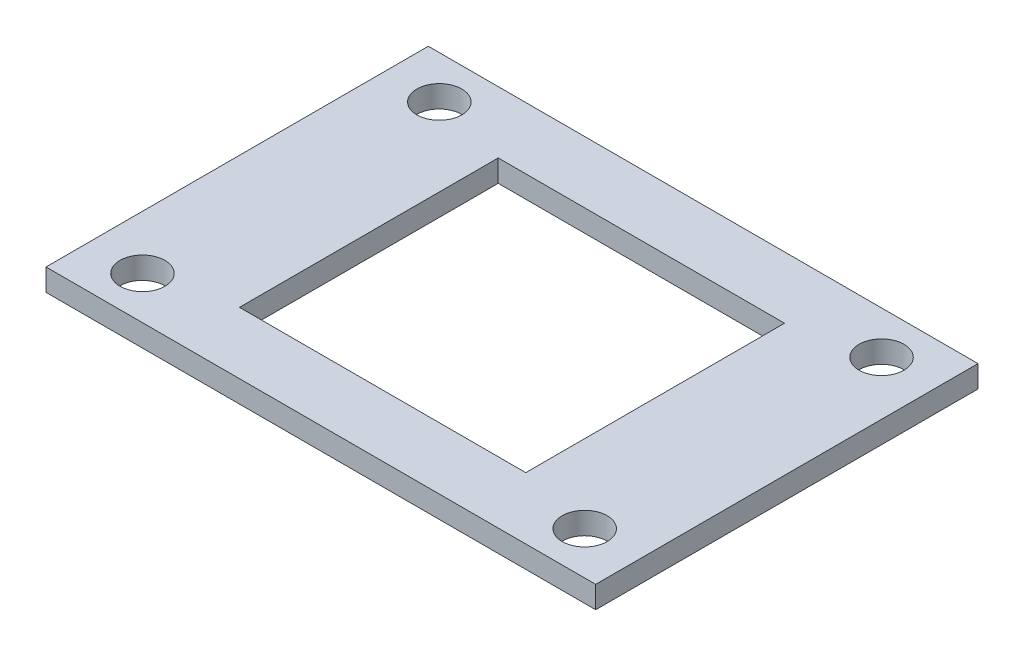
ISO-10303-21;
HEADER;
FILE_DESCRIPTION(('STEP AP214'),'2;1');
FILE_NAME('part.step','',(''),(''),'','','');
FILE_SCHEMA(('AUTOMOTIVE_DESIGN { 1 0 10303 214 1 1 1 1 }'));
ENDSEC;
DATA;
#1=APPLICATION_CONTEXT('core data for automotive mechanical design processes');
#2=APPLICATION_PROTOCOL_DEFINITION('international standard','automotive_design',2000,#1);
#3=PRODUCT_CONTEXT('',#1,'mechanical');
#4=PRODUCT('Part','Part','',(#3));
#5=PRODUCT_RELATED_PRODUCT_CATEGORY('part','',(#4));
#6=PRODUCT_DEFINITION_FORMATION('','',#4);
#7=PRODUCT_DEFINITION_CONTEXT('part definition',#1,'design');
#8=PRODUCT_DEFINITION('design','',#6,#7);
#9=PRODUCT_DEFINITION_SHAPE('','',#8);
#10=(LENGTH_UNIT() NAMED_UNIT(*) SI_UNIT(.MILLI.,.METRE.));
#11=(NAMED_UNIT(*) PLANE_ANGLE_UNIT() SI_UNIT($,.RADIAN.));
#12=(NAMED_UNIT(*) SI_UNIT($,.STERADIAN.) SOLID_ANGLE_UNIT());
#13=UNCERTAINTY_MEASURE_WITH_UNIT(LENGTH_MEASURE(1.E-05),#10,'distance_accuracy_value','');
#14=(GEOMETRIC_REPRESENTATION_CONTEXT(3) GLOBAL_UNCERTAINTY_ASSIGNED_CONTEXT((#13)) GLOBAL_UNIT_ASSIGNED_CONTEXT((#10,
#11,#12)) REPRESENTATION_CONTEXT('',''));
#15=CARTESIAN_POINT('',(0.,0.,0.));
#16=DIRECTION('',(0.,0.,1.));
#17=DIRECTION('',(1.,0.,0.));
#18=AXIS2_PLACEMENT_3D('',#15,#16,#17);
#19=CARTESIAN_POINT('',(0.,-1.,0.));
#20=DIRECTION('',(-1.,0.,0.));
#21=DIRECTION('',(0.,0.,1.));
#22=AXIS2_PLACEMENT_3D('',#19,#20,#21);
#23=PLANE('',#22);
#24=DIRECTION('',(0.,0.,1.));
#25=VECTOR('',#24,1.);
#26=CARTESIAN_POINT('',(0.,0.,0.));
#27=LINE('',#26,#25);
#28=CARTESIAN_POINT('',(0.,0.,0.));
#29=VERTEX_POINT('',#28);
#30=CARTESIAN_POINT('',(0.,0.,17.36));
#31=VERTEX_POINT('',#30);
#32=EDGE_CURVE('E134',#29,#31,#27,.T.);
#33=ORIENTED_EDGE('',*,*,#32,.F.);
#34=DIRECTION('',(0.,1.,0.));
#35=VECTOR('',#34,1.);
#36=CARTESIAN_POINT('',(0.,-1.,0.));
#37=LINE('',#36,#35);
#38=CARTESIAN_POINT('',(0.,-1.,0.));
#39=VERTEX_POINT('',#38);
#40=EDGE_CURVE('E11',#39,#29,#37,.T.);
#41=ORIENTED_EDGE('',*,*,#40,.F.);
#42=DIRECTION('',(0.,0.,1.));
#43=VECTOR('',#42,1.);
#44=CARTESIAN_POINT('',(0.,-1.,0.));
#45=LINE('',#44,#43);
#46=CARTESIAN_POINT('',(0.,-1.,17.36));
#47=VERTEX_POINT('',#46);
#48=EDGE_CURVE('E138',#39,#47,#45,.T.);
#49=ORIENTED_EDGE('',*,*,#48,.T.);
#50=DIRECTION('',(0.,1.,0.));
#51=VECTOR('',#50,1.);
#52=CARTESIAN_POINT('',(0.,-1.,17.36));
#53=LINE('',#52,#51);
#54=EDGE_CURVE('E35',#47,#31,#53,.T.);
#55=ORIENTED_EDGE('',*,*,#54,.T.);
#56=EDGE_LOOP('',(#33,#41,#49,#55));
#57=FACE_BOUND('',#56,.T.);
#58=ADVANCED_FACE('F32',(#57),#23,.T.);
#59=CARTESIAN_POINT('',(0.,-1.,0.));
#60=DIRECTION('',(0.,0.,-1.));
#61=DIRECTION('',(-1.,0.,0.));
#62=AXIS2_PLACEMENT_3D('',#59,#60,#61);
#63=PLANE('',#62);
#64=DIRECTION('',(-1.,0.,0.));
#65=VECTOR('',#64,1.);
#66=CARTESIAN_POINT('',(0.,0.,0.));
#67=LINE('',#66,#65);
#68=CARTESIAN_POINT('',(24.96,0.,0.));
#69=VERTEX_POINT('',#68);
#70=EDGE_CURVE('E142',#69,#29,#67,.T.);
#71=ORIENTED_EDGE('',*,*,#70,.F.);
#72=DIRECTION('',(0.,1.,0.));
#73=VECTOR('',#72,1.);
#74=CARTESIAN_POINT('',(24.96,-1.,0.));
#75=LINE('',#74,#73);
#76=CARTESIAN_POINT('',(24.96,-1.,0.));
#77=VERTEX_POINT('',#76);
#78=EDGE_CURVE('E40',#77,#69,#75,.T.);
#79=ORIENTED_EDGE('',*,*,#78,.F.);
#80=DIRECTION('',(-1.,0.,0.));
#81=VECTOR('',#80,1.);
#82=CARTESIAN_POINT('',(0.,-1.,0.));
#83=LINE('',#82,#81);
#84=EDGE_CURVE('E148',#77,#39,#83,.T.);
#85=ORIENTED_EDGE('',*,*,#84,.T.);
#86=ORIENTED_EDGE('',*,*,#40,.T.);
#87=EDGE_LOOP('',(#71,#79,#85,#86));
#88=FACE_BOUND('',#87,.T.);
#89=ADVANCED_FACE('F174',(#88),#63,.T.);
#90=CARTESIAN_POINT('',(24.96,-1.,0.));
#91=DIRECTION('',(1.,0.,0.));
#92=DIRECTION('',(0.,0.,-1.));
#93=AXIS2_PLACEMENT_3D('',#90,#91,#92);
#94=PLANE('',#93);
#95=DIRECTION('',(0.,0.,-1.));
#96=VECTOR('',#95,1.);
#97=CARTESIAN_POINT('',(24.96,0.,0.));
#98=LINE('',#97,#96);
#99=CARTESIAN_POINT('',(24.96,0.,17.36));
#100=VERTEX_POINT('',#99);
#101=EDGE_CURVE('E156',#100,#69,#98,.T.);
#102=ORIENTED_EDGE('',*,*,#101,.F.);
#103=DIRECTION('',(0.,1.,0.));
#104=VECTOR('',#103,1.);
#105=CARTESIAN_POINT('',(24.96,-1.,17.36));
#106=LINE('',#105,#104);
#107=CARTESIAN_POINT('',(24.96,-1.,17.36));
#108=VERTEX_POINT('',#107);
#109=EDGE_CURVE('E161',#108,#100,#106,.T.);
#110=ORIENTED_EDGE('',*,*,#109,.F.);
#111=DIRECTION('',(0.,0.,-1.));
#112=VECTOR('',#111,1.);
#113=CARTESIAN_POINT('',(24.96,-1.,0.));
#114=LINE('',#113,#112);
#115=EDGE_CURVE('E145',#108,#77,#114,.T.);
#116=ORIENTED_EDGE('',*,*,#115,.T.);
#117=ORIENTED_EDGE('',*,*,#78,.T.);
#118=EDGE_LOOP('',(#102,#110,#116,#117));
#119=FACE_BOUND('',#118,.T.);
#120=ADVANCED_FACE('F178',(#119),#94,.T.);
#121=CARTESIAN_POINT('',(0.,-1.,17.36));
#122=DIRECTION('',(0.,0.,1.));
#123=DIRECTION('',(1.,0.,0.));
#124=AXIS2_PLACEMENT_3D('',#121,#122,#123);
#125=PLANE('',#124);
#126=DIRECTION('',(1.,0.,0.));
#127=VECTOR('',#126,1.);
#128=CARTESIAN_POINT('',(0.,0.,17.36));
#129=LINE('',#128,#127);
#130=EDGE_CURVE('E153',#31,#100,#129,.T.);
#131=ORIENTED_EDGE('',*,*,#130,.F.);
#132=ORIENTED_EDGE('',*,*,#54,.F.);
#133=DIRECTION('',(1.,0.,0.));
#134=VECTOR('',#133,1.);
#135=CARTESIAN_POINT('',(0.,-1.,17.36));
#136=LINE('',#135,#134);
#137=EDGE_CURVE('E141',#47,#108,#136,.T.);
#138=ORIENTED_EDGE('',*,*,#137,.T.);
#139=ORIENTED_EDGE('',*,*,#109,.T.);
#140=EDGE_LOOP('',(#131,#132,#138,#139));
#141=FACE_BOUND('',#140,.T.);
#142=ADVANCED_FACE('F169',(#141),#125,.T.);
#143=CARTESIAN_POINT('',(0.,-1.,0.));
#144=DIRECTION('',(0.,1.,0.));
#145=DIRECTION('',(0.,0.,1.));
#146=AXIS2_PLACEMENT_3D('',#143,#144,#145);
#147=PLANE('',#146);
#148=CARTESIAN_POINT('',(2.44,-1.,15.42));
#149=DIRECTION('',(0.,1.,0.));
#150=DIRECTION('',(0.,0.,1.));
#151=AXIS2_PLACEMENT_3D('',#148,#149,#150);
#152=CIRCLE('',#151,1.02);
#153=CARTESIAN_POINT('',(2.44,-1.,16.44));
#154=VERTEX_POINT('',#153);
#155=EDGE_CURVE('E303',#154,#154,#152,.T.);
#156=ORIENTED_EDGE('',*,*,#155,.T.);
#157=EDGE_LOOP('',(#156));
#158=FACE_BOUND('',#157,.T.);
#159=CARTESIAN_POINT('',(22.52,-1.,15.42));
#160=DIRECTION('',(0.,1.,0.));
#161=DIRECTION('',(0.,0.,1.));
#162=AXIS2_PLACEMENT_3D('',#159,#160,#161);
#163=CIRCLE('',#162,1.02);
#164=CARTESIAN_POINT('',(22.52,-1.,16.44));
#165=VERTEX_POINT('',#164);
#166=EDGE_CURVE('E324',#165,#165,#163,.T.);
#167=ORIENTED_EDGE('',*,*,#166,.T.);
#168=EDGE_LOOP('',(#167));
#169=FACE_BOUND('',#168,.T.);
#170=CARTESIAN_POINT('',(22.52,-1.,1.94));
#171=DIRECTION('',(0.,1.,0.));
#172=DIRECTION('',(0.,0.,1.));
#173=AXIS2_PLACEMENT_3D('',#170,#171,#172);
#174=CIRCLE('',#173,1.02);
#175=CARTESIAN_POINT('',(22.52,-1.,2.96));
#176=VERTEX_POINT('',#175);
#177=EDGE_CURVE('E315',#176,#176,#174,.T.);
#178=ORIENTED_EDGE('',*,*,#177,.T.);
#179=EDGE_LOOP('',(#178));
#180=FACE_BOUND('',#179,.T.);
#181=CARTESIAN_POINT('',(2.44,-1.,1.94));
#182=DIRECTION('',(0.,1.,0.));
#183=DIRECTION('',(0.,0.,1.));
#184=AXIS2_PLACEMENT_3D('',#181,#182,#183);
#185=CIRCLE('',#184,1.02);
#186=CARTESIAN_POINT('',(2.44,-1.,2.96));
#187=VERTEX_POINT('',#186);
#188=EDGE_CURVE('E128',#187,#187,#185,.T.);
#189=ORIENTED_EDGE('',*,*,#188,.T.);
#190=EDGE_LOOP('',(#189));
#191=FACE_BOUND('',#190,.T.);
#192=DIRECTION('',(-1.,0.,0.));
#193=VECTOR('',#192,1.);
#194=CARTESIAN_POINT('',(5.98,-1.,2.805));
#195=LINE('',#194,#193);
#196=CARTESIAN_POINT('',(18.98,-1.,2.805));
#197=VERTEX_POINT('',#196);
#198=CARTESIAN_POINT('',(5.98,-1.,2.805));
#199=VERTEX_POINT('',#198);
#200=EDGE_CURVE('E105',#197,#199,#195,.T.);
#201=ORIENTED_EDGE('',*,*,#200,.T.);
#202=DIRECTION('',(0.,0.,1.));
#203=VECTOR('',#202,1.);
#204=CARTESIAN_POINT('',(5.98,-1.,2.805));
#205=LINE('',#204,#203);
#206=CARTESIAN_POINT('',(5.98000000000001,-1.,14.555));
#207=VERTEX_POINT('',#206);
#208=EDGE_CURVE('E99',#199,#207,#205,.T.);
#209=ORIENTED_EDGE('',*,*,#208,.T.);
#210=DIRECTION('',(1.,0.,0.));
#211=VECTOR('',#210,1.);
#212=CARTESIAN_POINT('',(5.98000000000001,-1.,14.555));
#213=LINE('',#212,#211);
#214=CARTESIAN_POINT('',(18.98,-1.,14.555));
#215=VERTEX_POINT('',#214);
#216=EDGE_CURVE('E108',#207,#215,#213,.T.);
#217=ORIENTED_EDGE('',*,*,#216,.T.);
#218=DIRECTION('',(0.,0.,-1.));
#219=VECTOR('',#218,1.);
#220=CARTESIAN_POINT('',(18.98,-1.,2.805));
#221=LINE('',#220,#219);
#222=EDGE_CURVE('E48',#215,#197,#221,.T.);
#223=ORIENTED_EDGE('',*,*,#222,.T.);
#224=EDGE_LOOP('',(#201,#209,#217,#223));
#225=FACE_BOUND('',#224,.T.);
#226=ORIENTED_EDGE('',*,*,#48,.F.);
#227=ORIENTED_EDGE('',*,*,#84,.F.);
#228=ORIENTED_EDGE('',*,*,#115,.F.);
#229=ORIENTED_EDGE('',*,*,#137,.F.);
#230=EDGE_LOOP('',(#226,#227,#228,#229));
#231=FACE_BOUND('',#230,.T.);
#232=ADVANCED_FACE('F112',(#158,#169,#180,#191,#225,#231),#147,.F.);
#233=CARTESIAN_POINT('',(0.,0.,0.));
#234=DIRECTION('',(0.,1.,0.));
#235=DIRECTION('',(0.,0.,1.));
#236=AXIS2_PLACEMENT_3D('',#233,#234,#235);
#237=PLANE('',#236);
#238=CARTESIAN_POINT('',(2.44,0.,15.42));
#239=DIRECTION('',(0.,1.,0.));
#240=DIRECTION('',(0.,0.,1.));
#241=AXIS2_PLACEMENT_3D('',#238,#239,#240);
#242=CIRCLE('',#241,1.02);
#243=CARTESIAN_POINT('',(2.44,0.,16.44));
#244=VERTEX_POINT('',#243);
#245=EDGE_CURVE('E306',#244,#244,#242,.T.);
#246=ORIENTED_EDGE('',*,*,#245,.F.);
#247=EDGE_LOOP('',(#246));
#248=FACE_BOUND('',#247,.T.);
#249=CARTESIAN_POINT('',(22.52,0.,15.42));
#250=DIRECTION('',(0.,1.,0.));
#251=DIRECTION('',(0.,0.,1.));
#252=AXIS2_PLACEMENT_3D('',#249,#250,#251);
#253=CIRCLE('',#252,1.02);
#254=CARTESIAN_POINT('',(22.52,0.,16.44));
#255=VERTEX_POINT('',#254);
#256=EDGE_CURVE('E308',#255,#255,#253,.T.);
#257=ORIENTED_EDGE('',*,*,#256,.F.);
#258=EDGE_LOOP('',(#257));
#259=FACE_BOUND('',#258,.T.);
#260=CARTESIAN_POINT('',(22.52,0.,1.94));
#261=DIRECTION('',(0.,1.,0.));
#262=DIRECTION('',(0.,0.,1.));
#263=AXIS2_PLACEMENT_3D('',#260,#261,#262);
#264=CIRCLE('',#263,1.02);
#265=CARTESIAN_POINT('',(22.52,0.,2.96));
#266=VERTEX_POINT('',#265);
#267=EDGE_CURVE('E319',#266,#266,#264,.T.);
#268=ORIENTED_EDGE('',*,*,#267,.F.);
#269=EDGE_LOOP('',(#268));
#270=FACE_BOUND('',#269,.T.);
#271=CARTESIAN_POINT('',(2.44,0.,1.94));
#272=DIRECTION('',(0.,1.,0.));
#273=DIRECTION('',(0.,0.,1.));
#274=AXIS2_PLACEMENT_3D('',#271,#272,#273);
#275=CIRCLE('',#274,1.02);
#276=CARTESIAN_POINT('',(2.44,0.,2.96));
#277=VERTEX_POINT('',#276);
#278=EDGE_CURVE('E121',#277,#277,#275,.T.);
#279=ORIENTED_EDGE('',*,*,#278,.F.);
#280=EDGE_LOOP('',(#279));
#281=FACE_BOUND('',#280,.T.);
#282=DIRECTION('',(0.,0.,1.));
#283=VECTOR('',#282,1.);
#284=CARTESIAN_POINT('',(5.98,0.,2.805));
#285=LINE('',#284,#283);
#286=CARTESIAN_POINT('',(5.98,0.,2.805));
#287=VERTEX_POINT('',#286);
#288=CARTESIAN_POINT('',(5.98000000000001,0.,14.555));
#289=VERTEX_POINT('',#288);
#290=EDGE_CURVE('E56',#287,#289,#285,.T.);
#291=ORIENTED_EDGE('',*,*,#290,.F.);
#292=DIRECTION('',(-1.,0.,0.));
#293=VECTOR('',#292,1.);
#294=CARTESIAN_POINT('',(5.98,0.,2.805));
#295=LINE('',#294,#293);
#296=CARTESIAN_POINT('',(18.98,0.,2.805));
#297=VERTEX_POINT('',#296);
#298=EDGE_CURVE('E115',#297,#287,#295,.T.);
#299=ORIENTED_EDGE('',*,*,#298,.F.);
#300=DIRECTION('',(0.,0.,-1.));
#301=VECTOR('',#300,1.);
#302=CARTESIAN_POINT('',(18.98,0.,2.805));
#303=LINE('',#302,#301);
#304=CARTESIAN_POINT('',(18.98,0.,14.555));
#305=VERTEX_POINT('',#304);
#306=EDGE_CURVE('E118',#305,#297,#303,.T.);
#307=ORIENTED_EDGE('',*,*,#306,.F.);
#308=DIRECTION('',(1.,0.,0.));
#309=VECTOR('',#308,1.);
#310=CARTESIAN_POINT('',(5.98000000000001,0.,14.555));
#311=LINE('',#310,#309);
#312=EDGE_CURVE('E127',#289,#305,#311,.T.);
#313=ORIENTED_EDGE('',*,*,#312,.F.);
#314=EDGE_LOOP('',(#291,#299,#307,#313));
#315=FACE_BOUND('',#314,.T.);
#316=ORIENTED_EDGE('',*,*,#32,.T.);
#317=ORIENTED_EDGE('',*,*,#130,.T.);
#318=ORIENTED_EDGE('',*,*,#101,.T.);
#319=ORIENTED_EDGE('',*,*,#70,.T.);
#320=EDGE_LOOP('',(#316,#317,#318,#319));
#321=FACE_BOUND('',#320,.T.);
#322=ADVANCED_FACE('F171',(#248,#259,#270,#281,#315,#321),#237,.T.);
#323=CARTESIAN_POINT('',(5.98,-1.,2.805));
#324=DIRECTION('',(-1.,0.,0.));
#325=DIRECTION('',(0.,0.,1.));
#326=AXIS2_PLACEMENT_3D('',#323,#324,#325);
#327=PLANE('',#326);
#328=ORIENTED_EDGE('',*,*,#290,.T.);
#329=DIRECTION('',(0.,1.,0.));
#330=VECTOR('',#329,1.);
#331=CARTESIAN_POINT('',(5.98000000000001,-1.,14.555));
#332=LINE('',#331,#330);
#333=EDGE_CURVE('E95',#207,#289,#332,.T.);
#334=ORIENTED_EDGE('',*,*,#333,.F.);
#335=ORIENTED_EDGE('',*,*,#208,.F.);
#336=DIRECTION('',(0.,1.,0.));
#337=VECTOR('',#336,1.);
#338=CARTESIAN_POINT('',(5.98,-1.,2.805));
#339=LINE('',#338,#337);
#340=EDGE_CURVE('E132',#199,#287,#339,.T.);
#341=ORIENTED_EDGE('',*,*,#340,.T.);
#342=EDGE_LOOP('',(#328,#334,#335,#341));
#343=FACE_BOUND('',#342,.T.);
#344=ADVANCED_FACE('F97',(#343),#327,.F.);
#345=CARTESIAN_POINT('',(5.98,-1.,2.805));
#346=DIRECTION('',(0.,0.,-1.));
#347=DIRECTION('',(-1.,0.,0.));
#348=AXIS2_PLACEMENT_3D('',#345,#346,#347);
#349=PLANE('',#348);
#350=ORIENTED_EDGE('',*,*,#298,.T.);
#351=ORIENTED_EDGE('',*,*,#340,.F.);
#352=ORIENTED_EDGE('',*,*,#200,.F.);
#353=DIRECTION('',(0.,1.,0.));
#354=VECTOR('',#353,1.);
#355=CARTESIAN_POINT('',(18.98,-1.,2.805));
#356=LINE('',#355,#354);
#357=EDGE_CURVE('E135',#197,#297,#356,.T.);
#358=ORIENTED_EDGE('',*,*,#357,.T.);
#359=EDGE_LOOP('',(#350,#351,#352,#358));
#360=FACE_BOUND('',#359,.T.);
#361=ADVANCED_FACE('F214',(#360),#349,.F.);
#362=CARTESIAN_POINT('',(18.98,-1.,2.805));
#363=DIRECTION('',(1.,0.,0.));
#364=DIRECTION('',(0.,0.,-1.));
#365=AXIS2_PLACEMENT_3D('',#362,#363,#364);
#366=PLANE('',#365);
#367=ORIENTED_EDGE('',*,*,#306,.T.);
#368=ORIENTED_EDGE('',*,*,#357,.F.);
#369=ORIENTED_EDGE('',*,*,#222,.F.);
#370=DIRECTION('',(0.,1.,0.));
#371=VECTOR('',#370,1.);
#372=CARTESIAN_POINT('',(18.98,-1.,14.555));
#373=LINE('',#372,#371);
#374=EDGE_CURVE('E104',#215,#305,#373,.T.);
#375=ORIENTED_EDGE('',*,*,#374,.T.);
#376=EDGE_LOOP('',(#367,#368,#369,#375));
#377=FACE_BOUND('',#376,.T.);
#378=ADVANCED_FACE('F225',(#377),#366,.F.);
#379=CARTESIAN_POINT('',(5.98000000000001,-1.,14.555));
#380=DIRECTION('',(0.,0.,1.));
#381=DIRECTION('',(1.,0.,0.));
#382=AXIS2_PLACEMENT_3D('',#379,#380,#381);
#383=PLANE('',#382);
#384=ORIENTED_EDGE('',*,*,#312,.T.);
#385=ORIENTED_EDGE('',*,*,#374,.F.);
#386=ORIENTED_EDGE('',*,*,#216,.F.);
#387=ORIENTED_EDGE('',*,*,#333,.T.);
#388=EDGE_LOOP('',(#384,#385,#386,#387));
#389=FACE_BOUND('',#388,.T.);
#390=ADVANCED_FACE('F109',(#389),#383,.F.);
#391=CARTESIAN_POINT('',(2.44,-1.,1.94));
#392=DIRECTION('',(0.,1.,0.));
#393=DIRECTION('',(0.,0.,1.));
#394=AXIS2_PLACEMENT_3D('',#391,#392,#393);
#395=CYLINDRICAL_SURFACE('',#394,1.02);
#396=ORIENTED_EDGE('',*,*,#188,.F.);
#397=EDGE_LOOP('',(#396));
#398=FACE_BOUND('',#397,.T.);
#399=ORIENTED_EDGE('',*,*,#278,.T.);
#400=EDGE_LOOP('',(#399));
#401=FACE_BOUND('',#400,.T.);
#402=ADVANCED_FACE('F243',(#398,#401),#395,.F.);
#403=CARTESIAN_POINT('',(22.52,-1.,1.94));
#404=DIRECTION('',(0.,1.,0.));
#405=DIRECTION('',(0.,0.,1.));
#406=AXIS2_PLACEMENT_3D('',#403,#404,#405);
#407=CYLINDRICAL_SURFACE('',#406,1.02);
#408=ORIENTED_EDGE('',*,*,#177,.F.);
#409=EDGE_LOOP('',(#408));
#410=FACE_BOUND('',#409,.T.);
#411=ORIENTED_EDGE('',*,*,#267,.T.);
#412=EDGE_LOOP('',(#411));
#413=FACE_BOUND('',#412,.T.);
#414=ADVANCED_FACE('F266',(#410,#413),#407,.F.);
#415=CARTESIAN_POINT('',(22.52,-1.,15.42));
#416=DIRECTION('',(0.,1.,0.));
#417=DIRECTION('',(0.,0.,1.));
#418=AXIS2_PLACEMENT_3D('',#415,#416,#417);
#419=CYLINDRICAL_SURFACE('',#418,1.02);
#420=ORIENTED_EDGE('',*,*,#166,.F.);
#421=EDGE_LOOP('',(#420));
#422=FACE_BOUND('',#421,.T.);
#423=ORIENTED_EDGE('',*,*,#256,.T.);
#424=EDGE_LOOP('',(#423));
#425=FACE_BOUND('',#424,.T.);
#426=ADVANCED_FACE('F276',(#422,#425),#419,.F.);
#427=CARTESIAN_POINT('',(2.44,-1.,15.42));
#428=DIRECTION('',(0.,1.,0.));
#429=DIRECTION('',(0.,0.,1.));
#430=AXIS2_PLACEMENT_3D('',#427,#428,#429);
#431=CYLINDRICAL_SURFACE('',#430,1.02);
#432=ORIENTED_EDGE('',*,*,#155,.F.);
#433=EDGE_LOOP('',(#432));
#434=FACE_BOUND('',#433,.T.);
#435=ORIENTED_EDGE('',*,*,#245,.T.);
#436=EDGE_LOOP('',(#435));
#437=FACE_BOUND('',#436,.T.);
#438=ADVANCED_FACE('F286',(#434,#437),#431,.F.);
#439=CLOSED_SHELL('',(#58,#89,#120,#142,#232,#322,#344,#361,#378,#390,#402,#414,#426,#438));
#440=MANIFOLD_SOLID_BREP('B2',#439);
#441=ADVANCED_BREP_SHAPE_REPRESENTATION('',(#18,#440),#14);
#442=SHAPE_DEFINITION_REPRESENTATION(#9,#441);
ENDSEC;
END-ISO-10303-21;
